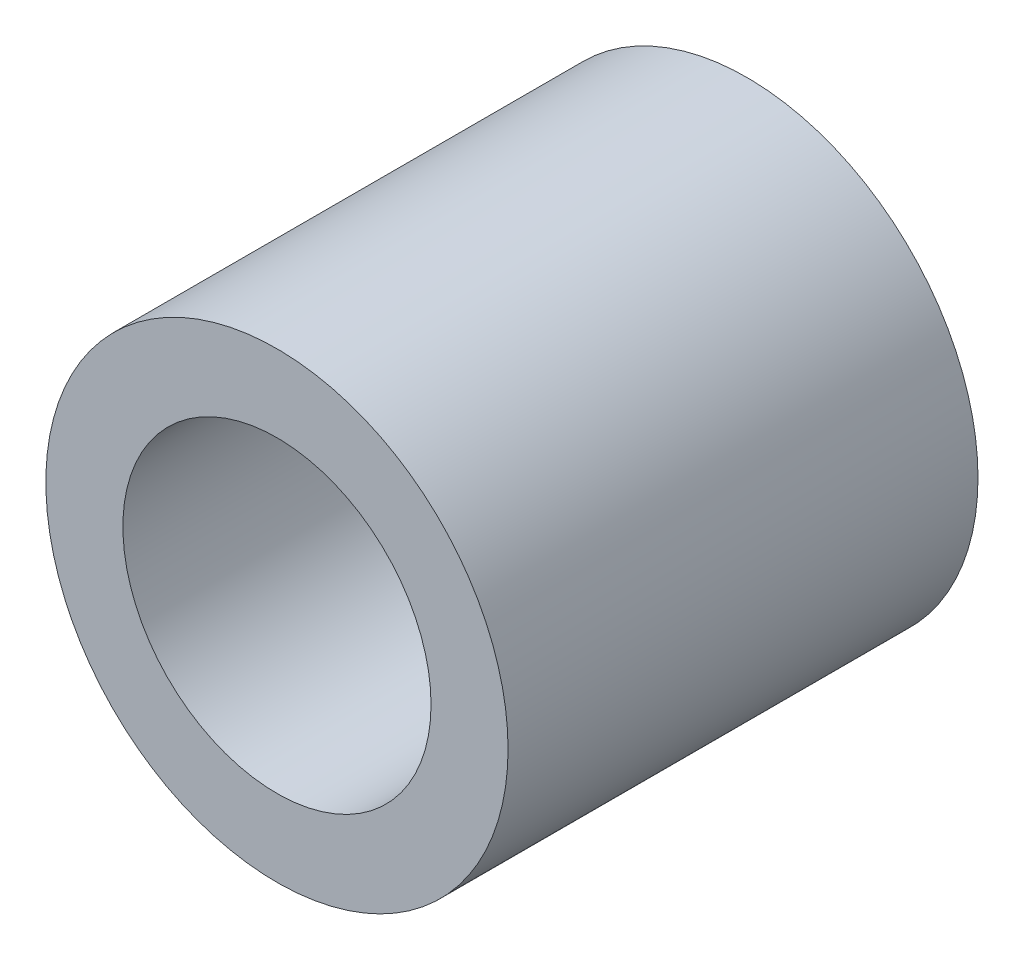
from build123d import *

# Parameters (mm, degrees)
ESQUISSE1_R      = 3
ESQUISSE1_R_2    = 2
EXTRUSION1_DEPTH = 6.1


with BuildPart() as part:
    # Esquisse1 → Extrusion1 (new body)
    with BuildSketch(Plane.XY):
        Circle(ESQUISSE1_R)
        Circle(ESQUISSE1_R_2, mode=Mode.SUBTRACT)
    extrude(amount=EXTRUSION1_DEPTH)


solid = part.part
